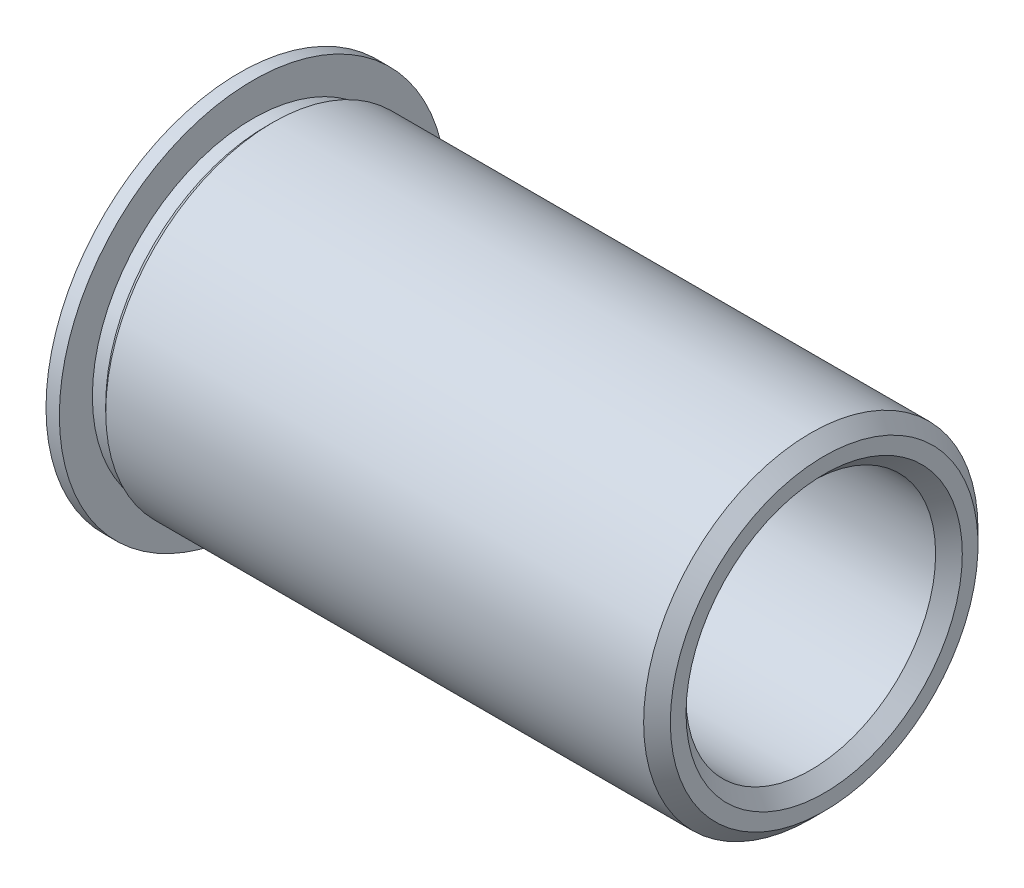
ISO-10303-21;
HEADER;
FILE_DESCRIPTION(('STEP AP214'),'2;1');
FILE_NAME('part.step','',(''),(''),'','','');
FILE_SCHEMA(('AUTOMOTIVE_DESIGN { 1 0 10303 214 1 1 1 1 }'));
ENDSEC;
DATA;
#1=APPLICATION_CONTEXT('core data for automotive mechanical design processes');
#2=APPLICATION_PROTOCOL_DEFINITION('international standard','automotive_design',2000,#1);
#3=PRODUCT_CONTEXT('',#1,'mechanical');
#4=PRODUCT('Part','Part','',(#3));
#5=PRODUCT_RELATED_PRODUCT_CATEGORY('part','',(#4));
#6=PRODUCT_DEFINITION_FORMATION('','',#4);
#7=PRODUCT_DEFINITION_CONTEXT('part definition',#1,'design');
#8=PRODUCT_DEFINITION('design','',#6,#7);
#9=PRODUCT_DEFINITION_SHAPE('','',#8);
#10=(LENGTH_UNIT() NAMED_UNIT(*) SI_UNIT(.MILLI.,.METRE.));
#11=(NAMED_UNIT(*) PLANE_ANGLE_UNIT() SI_UNIT($,.RADIAN.));
#12=(NAMED_UNIT(*) SI_UNIT($,.STERADIAN.) SOLID_ANGLE_UNIT());
#13=UNCERTAINTY_MEASURE_WITH_UNIT(LENGTH_MEASURE(1.E-05),#10,'distance_accuracy_value','');
#14=(GEOMETRIC_REPRESENTATION_CONTEXT(3) GLOBAL_UNCERTAINTY_ASSIGNED_CONTEXT((#13)) GLOBAL_UNIT_ASSIGNED_CONTEXT((#10,
#11,#12)) REPRESENTATION_CONTEXT('',''));
#15=CARTESIAN_POINT('',(0.,0.,0.));
#16=DIRECTION('',(0.,0.,1.));
#17=DIRECTION('',(1.,0.,0.));
#18=AXIS2_PLACEMENT_3D('',#15,#16,#17);
#19=CARTESIAN_POINT('',(-45.0910828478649,95.4400873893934,0.));
#20=DIRECTION('',(-1.,0.,0.));
#21=DIRECTION('',(0.,0.,1.));
#22=AXIS2_PLACEMENT_3D('',#19,#20,#21);
#23=PLANE('',#22);
#24=CARTESIAN_POINT('',(-45.0910828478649,95.4400873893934,0.));
#25=DIRECTION('',(-1.,0.,0.));
#26=DIRECTION('',(0.,0.,1.));
#27=AXIS2_PLACEMENT_3D('',#24,#25,#26);
#28=CIRCLE('',#27,2.62890000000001);
#29=CARTESIAN_POINT('',(-45.0910828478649,95.4400873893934,2.62890000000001));
#30=VERTEX_POINT('',#29);
#31=EDGE_CURVE('E10',#30,#30,#28,.T.);
#32=ORIENTED_EDGE('',*,*,#31,.T.);
#33=EDGE_LOOP('',(#32));
#34=FACE_BOUND('',#33,.T.);
#35=CARTESIAN_POINT('',(-45.0910828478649,95.4400873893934,0.));
#36=DIRECTION('',(-1.,0.,0.));
#37=DIRECTION('',(0.,0.,1.));
#38=AXIS2_PLACEMENT_3D('',#35,#36,#37);
#39=CIRCLE('',#38,2.92735);
#40=CARTESIAN_POINT('',(-45.0910828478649,95.4400873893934,2.92735));
#41=VERTEX_POINT('',#40);
#42=EDGE_CURVE('E52',#41,#41,#39,.T.);
#43=ORIENTED_EDGE('',*,*,#42,.F.);
#44=EDGE_LOOP('',(#43));
#45=FACE_BOUND('',#44,.T.);
#46=ADVANCED_FACE('F32',(#34,#45),#23,.F.);
#47=CARTESIAN_POINT('',(-45.0910828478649,95.4400873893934,0.));
#48=DIRECTION('',(-1.,0.,0.));
#49=DIRECTION('',(0.,0.,1.));
#50=AXIS2_PLACEMENT_3D('',#47,#48,#49);
#51=CONICAL_SURFACE('',#50,2.92735,0.785398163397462);
#52=CARTESIAN_POINT('',(-45.3450828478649,95.4400873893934,0.));
#53=DIRECTION('',(-1.,0.,0.));
#54=DIRECTION('',(0.,0.,1.));
#55=AXIS2_PLACEMENT_3D('',#52,#53,#54);
#56=CIRCLE('',#55,3.18135);
#57=CARTESIAN_POINT('',(-45.3450828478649,95.4400873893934,3.18135));
#58=VERTEX_POINT('',#57);
#59=EDGE_CURVE('E55',#58,#58,#56,.T.);
#60=ORIENTED_EDGE('',*,*,#59,.F.);
#61=EDGE_LOOP('',(#60));
#62=FACE_BOUND('',#61,.T.);
#63=ORIENTED_EDGE('',*,*,#42,.T.);
#64=EDGE_LOOP('',(#63));
#65=FACE_BOUND('',#64,.T.);
#66=ADVANCED_FACE('F103',(#62,#65),#51,.T.);
#67=CARTESIAN_POINT('',(-56.216282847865,95.4400873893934,0.));
#68=DIRECTION('',(-1.,0.,0.));
#69=DIRECTION('',(0.,0.,1.));
#70=AXIS2_PLACEMENT_3D('',#67,#68,#69);
#71=CYLINDRICAL_SURFACE('',#70,3.18135);
#72=CARTESIAN_POINT('',(-55.581282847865,95.4400873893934,0.));
#73=DIRECTION('',(-1.,0.,0.));
#74=DIRECTION('',(0.,0.,1.));
#75=AXIS2_PLACEMENT_3D('',#72,#73,#74);
#76=CIRCLE('',#75,3.18135);
#77=CARTESIAN_POINT('',(-55.581282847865,95.4400873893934,3.18135));
#78=VERTEX_POINT('',#77);
#79=EDGE_CURVE('E58',#78,#78,#76,.T.);
#80=ORIENTED_EDGE('',*,*,#79,.F.);
#81=EDGE_LOOP('',(#80));
#82=FACE_BOUND('',#81,.T.);
#83=ORIENTED_EDGE('',*,*,#59,.T.);
#84=EDGE_LOOP('',(#83));
#85=FACE_BOUND('',#84,.T.);
#86=ADVANCED_FACE('F97',(#82,#85),#71,.T.);
#87=CARTESIAN_POINT('',(-55.581282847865,95.4400873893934,0.));
#88=DIRECTION('',(1.,0.,0.));
#89=DIRECTION('',(0.,0.,-1.));
#90=AXIS2_PLACEMENT_3D('',#87,#88,#89);
#91=CONICAL_SURFACE('',#90,3.18135,0.785398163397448);
#92=CARTESIAN_POINT('',(-55.708282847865,95.4400873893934,0.));
#93=DIRECTION('',(-1.,0.,0.));
#94=DIRECTION('',(0.,0.,1.));
#95=AXIS2_PLACEMENT_3D('',#92,#93,#94);
#96=CIRCLE('',#95,3.05435);
#97=CARTESIAN_POINT('',(-55.708282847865,95.4400873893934,3.05435));
#98=VERTEX_POINT('',#97);
#99=EDGE_CURVE('E61',#98,#98,#96,.T.);
#100=ORIENTED_EDGE('',*,*,#99,.F.);
#101=EDGE_LOOP('',(#100));
#102=FACE_BOUND('',#101,.T.);
#103=ORIENTED_EDGE('',*,*,#79,.T.);
#104=EDGE_LOOP('',(#103));
#105=FACE_BOUND('',#104,.T.);
#106=ADVANCED_FACE('F91',(#102,#105),#91,.T.);
#107=CARTESIAN_POINT('',(-56.216282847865,95.4400873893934,0.));
#108=DIRECTION('',(-1.,0.,0.));
#109=DIRECTION('',(0.,0.,1.));
#110=AXIS2_PLACEMENT_3D('',#107,#108,#109);
#111=CYLINDRICAL_SURFACE('',#110,3.05435);
#112=CARTESIAN_POINT('',(-55.962282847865,95.4400873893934,0.));
#113=DIRECTION('',(-1.,0.,0.));
#114=DIRECTION('',(0.,0.,1.));
#115=AXIS2_PLACEMENT_3D('',#112,#113,#114);
#116=CIRCLE('',#115,3.05435);
#117=CARTESIAN_POINT('',(-55.962282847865,95.4400873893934,3.05435));
#118=VERTEX_POINT('',#117);
#119=EDGE_CURVE('E64',#118,#118,#116,.T.);
#120=ORIENTED_EDGE('',*,*,#119,.F.);
#121=EDGE_LOOP('',(#120));
#122=FACE_BOUND('',#121,.T.);
#123=ORIENTED_EDGE('',*,*,#99,.T.);
#124=EDGE_LOOP('',(#123));
#125=FACE_BOUND('',#124,.T.);
#126=ADVANCED_FACE('F85',(#122,#125),#111,.T.);
#127=CARTESIAN_POINT('',(-55.962282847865,98.4944373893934,0.));
#128=DIRECTION('',(-1.,0.,0.));
#129=DIRECTION('',(0.,0.,1.));
#130=AXIS2_PLACEMENT_3D('',#127,#128,#129);
#131=PLANE('',#130);
#132=CARTESIAN_POINT('',(-55.962282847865,95.4400873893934,0.));
#133=DIRECTION('',(-1.,0.,0.));
#134=DIRECTION('',(0.,0.,1.));
#135=AXIS2_PLACEMENT_3D('',#132,#133,#134);
#136=CIRCLE('',#135,3.68299999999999);
#137=CARTESIAN_POINT('',(-55.962282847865,95.4400873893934,3.68299999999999));
#138=VERTEX_POINT('',#137);
#139=EDGE_CURVE('E67',#138,#138,#136,.T.);
#140=ORIENTED_EDGE('',*,*,#139,.F.);
#141=EDGE_LOOP('',(#140));
#142=FACE_BOUND('',#141,.T.);
#143=ORIENTED_EDGE('',*,*,#119,.T.);
#144=EDGE_LOOP('',(#143));
#145=FACE_BOUND('',#144,.T.);
#146=ADVANCED_FACE('F79',(#142,#145),#131,.F.);
#147=CARTESIAN_POINT('',(-56.216282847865,95.4400873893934,0.));
#148=DIRECTION('',(-1.,0.,0.));
#149=DIRECTION('',(0.,0.,1.));
#150=AXIS2_PLACEMENT_3D('',#147,#148,#149);
#151=CYLINDRICAL_SURFACE('',#150,3.683);
#152=CARTESIAN_POINT('',(-56.216282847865,95.4400873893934,0.));
#153=DIRECTION('',(-1.,0.,0.));
#154=DIRECTION('',(0.,0.,1.));
#155=AXIS2_PLACEMENT_3D('',#152,#153,#154);
#156=CIRCLE('',#155,3.68300000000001);
#157=CARTESIAN_POINT('',(-56.216282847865,95.4400873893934,3.68300000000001));
#158=VERTEX_POINT('',#157);
#159=EDGE_CURVE('E70',#158,#158,#156,.T.);
#160=ORIENTED_EDGE('',*,*,#159,.F.);
#161=EDGE_LOOP('',(#160));
#162=FACE_BOUND('',#161,.T.);
#163=ORIENTED_EDGE('',*,*,#139,.T.);
#164=EDGE_LOOP('',(#163));
#165=FACE_BOUND('',#164,.T.);
#166=ADVANCED_FACE('F76',(#162,#165),#151,.T.);
#167=CARTESIAN_POINT('',(-56.216282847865,95.4400873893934,0.));
#168=DIRECTION('',(1.,0.,0.));
#169=DIRECTION('',(0.,0.,-1.));
#170=AXIS2_PLACEMENT_3D('',#167,#168,#169);
#171=PLANE('',#170);
#172=CARTESIAN_POINT('',(-56.216282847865,95.4400873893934,0.));
#173=DIRECTION('',(1.,0.,0.));
#174=DIRECTION('',(0.,0.,-1.));
#175=AXIS2_PLACEMENT_3D('',#172,#173,#174);
#176=CIRCLE('',#175,2.62889999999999);
#177=CARTESIAN_POINT('',(-56.216282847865,95.4400873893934,-2.62889999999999));
#178=VERTEX_POINT('',#177);
#179=EDGE_CURVE('E47',#178,#178,#176,.T.);
#180=ORIENTED_EDGE('',*,*,#179,.T.);
#181=EDGE_LOOP('',(#180));
#182=FACE_BOUND('',#181,.T.);
#183=ORIENTED_EDGE('',*,*,#159,.T.);
#184=EDGE_LOOP('',(#183));
#185=FACE_BOUND('',#184,.T.);
#186=ADVANCED_FACE('F74',(#182,#185),#171,.F.);
#187=CARTESIAN_POINT('',(-56.216282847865,95.4400873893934,0.));
#188=DIRECTION('',(1.,0.,0.));
#189=DIRECTION('',(0.,0.,-1.));
#190=AXIS2_PLACEMENT_3D('',#187,#188,#189);
#191=CYLINDRICAL_SURFACE('',#190,2.3749);
#192=CARTESIAN_POINT('',(-45.345082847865,95.4400873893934,0.));
#193=DIRECTION('',(-1.,0.,0.));
#194=DIRECTION('',(0.,0.,1.));
#195=AXIS2_PLACEMENT_3D('',#192,#193,#194);
#196=CIRCLE('',#195,2.3749);
#197=CARTESIAN_POINT('',(-45.345082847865,95.4400873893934,-2.3749));
#198=VERTEX_POINT('',#197);
#199=EDGE_CURVE('E39',#198,#198,#196,.F.);
#200=CARTESIAN_POINT('',(-55.962282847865,95.4400873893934,0.));
#201=DIRECTION('',(1.,0.,0.));
#202=DIRECTION('',(0.,0.,-1.));
#203=AXIS2_PLACEMENT_3D('',#200,#201,#202);
#204=CIRCLE('',#203,2.3749);
#205=CARTESIAN_POINT('',(-55.962282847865,95.4400873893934,-2.3749));
#206=VERTEX_POINT('',#205);
#207=EDGE_CURVE('E43',#206,#206,#204,.F.);
#208=CARTESIAN_POINT('',(-45.345082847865,95.4400873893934,-2.3749));
#209=CARTESIAN_POINT('',(-45.4556786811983,95.4400873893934,-2.3749));
#210=CARTESIAN_POINT('',(-45.5662745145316,95.4400873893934,-2.3749));
#211=CARTESIAN_POINT('',(-45.7874661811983,95.4400873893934,-2.3749));
#212=CARTESIAN_POINT('',(-45.8980620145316,95.4400873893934,-2.3749));
#213=CARTESIAN_POINT('',(-46.1192536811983,95.4400873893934,-2.3749));
#214=CARTESIAN_POINT('',(-46.2298495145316,95.4400873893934,-2.3749));
#215=CARTESIAN_POINT('',(-46.4510411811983,95.4400873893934,-2.3749));
#216=CARTESIAN_POINT('',(-46.5616370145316,95.4400873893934,-2.3749));
#217=CARTESIAN_POINT('',(-46.7828286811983,95.4400873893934,-2.3749));
#218=CARTESIAN_POINT('',(-46.8934245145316,95.4400873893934,-2.3749));
#219=CARTESIAN_POINT('',(-47.1146161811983,95.4400873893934,-2.3749));
#220=CARTESIAN_POINT('',(-47.2252120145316,95.4400873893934,-2.3749));
#221=CARTESIAN_POINT('',(-47.4464036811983,95.4400873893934,-2.3749));
#222=CARTESIAN_POINT('',(-47.5569995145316,95.4400873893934,-2.3749));
#223=CARTESIAN_POINT('',(-47.7781911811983,95.4400873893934,-2.3749));
#224=CARTESIAN_POINT('',(-47.8887870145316,95.4400873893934,-2.3749));
#225=CARTESIAN_POINT('',(-48.1099786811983,95.4400873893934,-2.3749));
#226=CARTESIAN_POINT('',(-48.2205745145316,95.4400873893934,-2.3749));
#227=CARTESIAN_POINT('',(-48.4417661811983,95.4400873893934,-2.3749));
#228=CARTESIAN_POINT('',(-48.5523620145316,95.4400873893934,-2.3749));
#229=CARTESIAN_POINT('',(-48.7735536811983,95.4400873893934,-2.3749));
#230=CARTESIAN_POINT('',(-48.8841495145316,95.4400873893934,-2.3749));
#231=CARTESIAN_POINT('',(-49.1053411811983,95.4400873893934,-2.3749));
#232=CARTESIAN_POINT('',(-49.2159370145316,95.4400873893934,-2.3749));
#233=CARTESIAN_POINT('',(-49.4371286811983,95.4400873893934,-2.3749));
#234=CARTESIAN_POINT('',(-49.5477245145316,95.4400873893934,-2.3749));
#235=CARTESIAN_POINT('',(-49.7689161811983,95.4400873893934,-2.3749));
#236=CARTESIAN_POINT('',(-49.8795120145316,95.4400873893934,-2.3749));
#237=CARTESIAN_POINT('',(-50.1007036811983,95.4400873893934,-2.3749));
#238=CARTESIAN_POINT('',(-50.2112995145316,95.4400873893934,-2.3749));
#239=CARTESIAN_POINT('',(-50.4324911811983,95.4400873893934,-2.3749));
#240=CARTESIAN_POINT('',(-50.5430870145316,95.4400873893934,-2.3749));
#241=CARTESIAN_POINT('',(-50.7642786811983,95.4400873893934,-2.3749));
#242=CARTESIAN_POINT('',(-50.8748745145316,95.4400873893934,-2.3749));
#243=CARTESIAN_POINT('',(-51.0960661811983,95.4400873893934,-2.3749));
#244=CARTESIAN_POINT('',(-51.2066620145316,95.4400873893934,-2.3749));
#245=CARTESIAN_POINT('',(-51.4278536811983,95.4400873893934,-2.3749));
#246=CARTESIAN_POINT('',(-51.5384495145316,95.4400873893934,-2.3749));
#247=CARTESIAN_POINT('',(-51.7596411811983,95.4400873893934,-2.3749));
#248=CARTESIAN_POINT('',(-51.8702370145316,95.4400873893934,-2.3749));
#249=CARTESIAN_POINT('',(-52.0914286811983,95.4400873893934,-2.3749));
#250=CARTESIAN_POINT('',(-52.2020245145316,95.4400873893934,-2.3749));
#251=CARTESIAN_POINT('',(-52.4232161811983,95.4400873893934,-2.3749));
#252=CARTESIAN_POINT('',(-52.5338120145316,95.4400873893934,-2.3749));
#253=CARTESIAN_POINT('',(-52.7550036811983,95.4400873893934,-2.3749));
#254=CARTESIAN_POINT('',(-52.8655995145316,95.4400873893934,-2.3749));
#255=CARTESIAN_POINT('',(-53.0867911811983,95.4400873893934,-2.3749));
#256=CARTESIAN_POINT('',(-53.1973870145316,95.4400873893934,-2.3749));
#257=CARTESIAN_POINT('',(-53.4185786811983,95.4400873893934,-2.3749));
#258=CARTESIAN_POINT('',(-53.5291745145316,95.4400873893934,-2.3749));
#259=CARTESIAN_POINT('',(-53.7503661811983,95.4400873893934,-2.3749));
#260=CARTESIAN_POINT('',(-53.8609620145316,95.4400873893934,-2.3749));
#261=CARTESIAN_POINT('',(-54.0821536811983,95.4400873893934,-2.3749));
#262=CARTESIAN_POINT('',(-54.1927495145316,95.4400873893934,-2.3749));
#263=CARTESIAN_POINT('',(-54.4139411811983,95.4400873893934,-2.3749));
#264=CARTESIAN_POINT('',(-54.5245370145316,95.4400873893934,-2.3749));
#265=CARTESIAN_POINT('',(-54.7457286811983,95.4400873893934,-2.3749));
#266=CARTESIAN_POINT('',(-54.8563245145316,95.4400873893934,-2.3749));
#267=CARTESIAN_POINT('',(-55.0775161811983,95.4400873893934,-2.3749));
#268=CARTESIAN_POINT('',(-55.1881120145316,95.4400873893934,-2.3749));
#269=CARTESIAN_POINT('',(-55.4093036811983,95.4400873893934,-2.3749));
#270=CARTESIAN_POINT('',(-55.5198995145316,95.4400873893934,-2.3749));
#271=CARTESIAN_POINT('',(-55.7410911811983,95.4400873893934,-2.3749));
#272=CARTESIAN_POINT('',(-55.8516870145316,95.4400873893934,-2.3749));
#273=CARTESIAN_POINT('',(-55.962282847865,95.4400873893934,-2.3749));
#274=B_SPLINE_CURVE_WITH_KNOTS('',3,(#208,#209,#210,#211,#212,#213,#214,#215,#216,#217,#218,
#219,#220,#221,#222,#223,#224,#225,#226,#227,#228,#229,#230,#231,#232,#233,#234,#235,#236,#237,
#238,#239,#240,#241,#242,#243,#244,#245,#246,#247,#248,#249,#250,#251,#252,#253,#254,#255,#256,
#257,#258,#259,#260,#261,#262,#263,#264,#265,#266,#267,#268,#269,#270,#271,#272,#273),
.UNSPECIFIED.,.F.,.F.,(4,2,2,2,2,2,2,2,2,2,2,2,2,2,2,2,2,2,2,2,2,2,2,2,2,2,2,2,2,2,2,2,4),(0.,
0.3317875,0.663575,0.995362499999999,1.32715,1.6589375,1.990725,2.3225125,2.6543,2.9860875,
3.317875,3.6496625,3.98145,4.3132375,4.645025,4.9768125,5.3086,5.6403875,5.972175,6.3039625,
6.63575,6.9675375,7.299325,7.6311125,7.9629,8.2946875,8.626475,8.9582625,9.29005,9.6218375,
9.953625,10.2854125,10.6172),.UNSPECIFIED.);
#275=EDGE_CURVE('BSEAM118',#198,#206,#274,.T.);
#276=ORIENTED_EDGE('',*,*,#199,.T.);
#277=ORIENTED_EDGE('',*,*,#207,.T.);
#278=ORIENTED_EDGE('',*,*,#275,.T.);
#279=ORIENTED_EDGE('',*,*,#275,.F.);
#280=EDGE_LOOP('',(#276,#278,#277,#279));
#281=FACE_BOUND('',#280,.T.);
#282=ADVANCED_FACE('F118',(#281),#191,.F.);
#283=CARTESIAN_POINT('',(-56.216282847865,95.4400873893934,0.));
#284=DIRECTION('',(-1.,0.,0.));
#285=DIRECTION('',(0.,0.,1.));
#286=AXIS2_PLACEMENT_3D('',#283,#284,#285);
#287=CONICAL_SURFACE('',#286,2.62889999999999,0.785398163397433);
#288=ORIENTED_EDGE('',*,*,#207,.F.);
#289=EDGE_LOOP('',(#288));
#290=FACE_BOUND('',#289,.T.);
#291=ORIENTED_EDGE('',*,*,#179,.F.);
#292=EDGE_LOOP('',(#291));
#293=FACE_BOUND('',#292,.T.);
#294=ADVANCED_FACE('F116',(#290,#293),#287,.F.);
#295=CARTESIAN_POINT('',(-45.345082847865,95.4400873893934,0.));
#296=DIRECTION('',(1.,0.,0.));
#297=DIRECTION('',(0.,0.,-1.));
#298=AXIS2_PLACEMENT_3D('',#295,#296,#297);
#299=CONICAL_SURFACE('',#298,2.3749,0.78539816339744);
#300=ORIENTED_EDGE('',*,*,#31,.F.);
#301=EDGE_LOOP('',(#300));
#302=FACE_BOUND('',#301,.T.);
#303=ORIENTED_EDGE('',*,*,#199,.F.);
#304=EDGE_LOOP('',(#303));
#305=FACE_BOUND('',#304,.T.);
#306=ADVANCED_FACE('F34',(#302,#305),#299,.F.);
#307=CLOSED_SHELL('',(#46,#66,#86,#106,#126,#146,#166,#186,#282,#294,#306));
#308=MANIFOLD_SOLID_BREP('B2',#307);
#309=ADVANCED_BREP_SHAPE_REPRESENTATION('',(#18,#308),#14);
#310=SHAPE_DEFINITION_REPRESENTATION(#9,#309);
ENDSEC;
END-ISO-10303-21;
